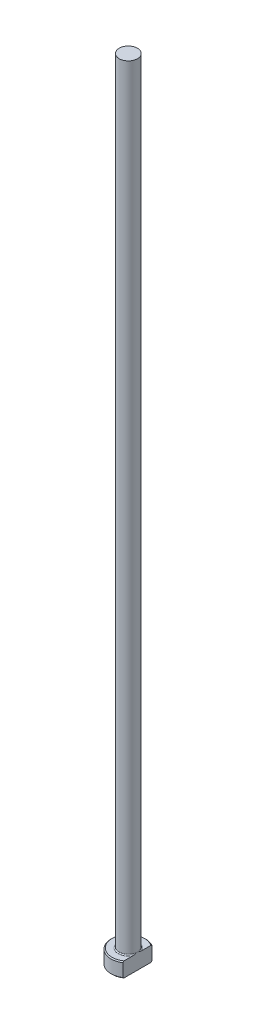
ISO-10303-21;
HEADER;
FILE_DESCRIPTION(('STEP AP214'),'2;1');
FILE_NAME('part.step','',(''),(''),'','','');
FILE_SCHEMA(('AUTOMOTIVE_DESIGN { 1 0 10303 214 1 1 1 1 }'));
ENDSEC;
DATA;
#1=APPLICATION_CONTEXT('core data for automotive mechanical design processes');
#2=APPLICATION_PROTOCOL_DEFINITION('international standard','automotive_design',2000,#1);
#3=PRODUCT_CONTEXT('',#1,'mechanical');
#4=PRODUCT('Part','Part','',(#3));
#5=PRODUCT_RELATED_PRODUCT_CATEGORY('part','',(#4));
#6=PRODUCT_DEFINITION_FORMATION('','',#4);
#7=PRODUCT_DEFINITION_CONTEXT('part definition',#1,'design');
#8=PRODUCT_DEFINITION('design','',#6,#7);
#9=PRODUCT_DEFINITION_SHAPE('','',#8);
#10=(LENGTH_UNIT() NAMED_UNIT(*) SI_UNIT(.MILLI.,.METRE.));
#11=(NAMED_UNIT(*) PLANE_ANGLE_UNIT() SI_UNIT($,.RADIAN.));
#12=(NAMED_UNIT(*) SI_UNIT($,.STERADIAN.) SOLID_ANGLE_UNIT());
#13=UNCERTAINTY_MEASURE_WITH_UNIT(LENGTH_MEASURE(1.E-05),#10,'distance_accuracy_value','');
#14=(GEOMETRIC_REPRESENTATION_CONTEXT(3) GLOBAL_UNCERTAINTY_ASSIGNED_CONTEXT((#13)) GLOBAL_UNIT_ASSIGNED_CONTEXT((#10,
#11,#12)) REPRESENTATION_CONTEXT('',''));
#15=CARTESIAN_POINT('',(0.,0.,0.));
#16=DIRECTION('',(0.,0.,1.));
#17=DIRECTION('',(1.,0.,0.));
#18=AXIS2_PLACEMENT_3D('',#15,#16,#17);
#19=CARTESIAN_POINT('',(0.,0.,0.));
#20=DIRECTION('',(0.,-1.,0.));
#21=DIRECTION('',(0.,0.,-1.));
#22=AXIS2_PLACEMENT_3D('',#19,#20,#21);
#23=PLANE('',#22);
#24=CARTESIAN_POINT('',(0.,0.,0.));
#25=DIRECTION('',(0.,-1.,0.));
#26=DIRECTION('',(0.,0.,-1.));
#27=AXIS2_PLACEMENT_3D('',#24,#25,#26);
#28=CIRCLE('',#27,3.29999999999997);
#29=CARTESIAN_POINT('',(1.84999999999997,0.,2.73267268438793));
#30=VERTEX_POINT('',#29);
#31=CARTESIAN_POINT('',(1.84999999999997,0.,-2.73267268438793));
#32=VERTEX_POINT('',#31);
#33=EDGE_CURVE('E98',#30,#32,#28,.T.);
#34=ORIENTED_EDGE('',*,*,#33,.T.);
#35=DIRECTION('',(0.,0.,1.));
#36=VECTOR('',#35,1.);
#37=CARTESIAN_POINT('',(1.84999999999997,0.,-2.9711109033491));
#38=LINE('',#37,#36);
#39=EDGE_CURVE('E83',#32,#30,#38,.T.);
#40=ORIENTED_EDGE('',*,*,#39,.T.);
#41=EDGE_LOOP('',(#34,#40));
#42=FACE_BOUND('',#41,.T.);
#43=ADVANCED_FACE('F32',(#42),#23,.T.);
#44=CARTESIAN_POINT('',(0.,259.958771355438,0.));
#45=DIRECTION('',(0.,1.,0.));
#46=DIRECTION('',(0.,0.,1.));
#47=AXIS2_PLACEMENT_3D('',#44,#45,#46);
#48=CYLINDRICAL_SURFACE('',#47,3.49999999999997);
#49=CARTESIAN_POINT('',(0.,2.79999999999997,0.));
#50=DIRECTION('',(0.,1.,0.));
#51=DIRECTION('',(0.,0.,1.));
#52=AXIS2_PLACEMENT_3D('',#49,#50,#51);
#53=CIRCLE('',#52,3.49999999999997);
#54=CARTESIAN_POINT('',(1.84999999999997,2.79999999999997,2.9711109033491));
#55=VERTEX_POINT('',#54);
#56=CARTESIAN_POINT('',(1.84999999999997,2.79999999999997,-2.9711109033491));
#57=VERTEX_POINT('',#56);
#58=EDGE_CURVE('E104',#55,#57,#53,.F.);
#59=ORIENTED_EDGE('',*,*,#58,.T.);
#60=DIRECTION('',(0.,-1.,0.));
#61=VECTOR('',#60,1.);
#62=CARTESIAN_POINT('',(1.84999999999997,160.,-2.9711109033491));
#63=LINE('',#62,#61);
#64=CARTESIAN_POINT('',(1.84999999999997,0.199999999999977,-2.9711109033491));
#65=VERTEX_POINT('',#64);
#66=EDGE_CURVE('E183',#57,#65,#63,.T.);
#67=ORIENTED_EDGE('',*,*,#66,.T.);
#68=CARTESIAN_POINT('',(0.,0.199999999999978,0.));
#69=DIRECTION('',(0.,-1.,0.));
#70=DIRECTION('',(0.,0.,-1.));
#71=AXIS2_PLACEMENT_3D('',#68,#69,#70);
#72=CIRCLE('',#71,3.49999999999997);
#73=CARTESIAN_POINT('',(1.84999999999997,0.199999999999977,2.9711109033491));
#74=VERTEX_POINT('',#73);
#75=EDGE_CURVE('E100',#65,#74,#72,.F.);
#76=ORIENTED_EDGE('',*,*,#75,.T.);
#77=DIRECTION('',(0.,-1.,0.));
#78=VECTOR('',#77,1.);
#79=CARTESIAN_POINT('',(1.84999999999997,160.,2.9711109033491));
#80=LINE('',#79,#78);
#81=EDGE_CURVE('E93',#55,#74,#80,.T.);
#82=ORIENTED_EDGE('',*,*,#81,.F.);
#83=EDGE_LOOP('',(#59,#67,#76,#82));
#84=FACE_BOUND('',#83,.T.);
#85=ADVANCED_FACE('F158',(#84),#48,.T.);
#86=CARTESIAN_POINT('',(-3.49999999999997,3.,0.));
#87=DIRECTION('',(0.,1.,0.));
#88=DIRECTION('',(0.,0.,1.));
#89=AXIS2_PLACEMENT_3D('',#86,#87,#88);
#90=PLANE('',#89);
#91=CARTESIAN_POINT('',(0.,3.,0.));
#92=DIRECTION('',(0.,1.,0.));
#93=DIRECTION('',(0.,0.,1.));
#94=AXIS2_PLACEMENT_3D('',#91,#92,#93);
#95=CIRCLE('',#94,3.29999999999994);
#96=CARTESIAN_POINT('',(1.84999999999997,3.,-2.7326726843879));
#97=VERTEX_POINT('',#96);
#98=CARTESIAN_POINT('',(1.84999999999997,3.,2.7326726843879));
#99=VERTEX_POINT('',#98);
#100=EDGE_CURVE('E178',#97,#99,#95,.T.);
#101=ORIENTED_EDGE('',*,*,#100,.T.);
#102=DIRECTION('',(0.,0.,-1.));
#103=VECTOR('',#102,1.);
#104=CARTESIAN_POINT('',(1.84999999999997,3.,0.));
#105=LINE('',#104,#103);
#106=CARTESIAN_POINT('',(1.84999999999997,2.99999999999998,0.883176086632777));
#107=VERTEX_POINT('',#106);
#108=EDGE_CURVE('E57',#99,#107,#105,.T.);
#109=ORIENTED_EDGE('',*,*,#108,.T.);
#110=CARTESIAN_POINT('',(0.,3.,0.));
#111=DIRECTION('',(0.,1.,0.));
#112=DIRECTION('',(0.,0.,1.));
#113=AXIS2_PLACEMENT_3D('',#110,#111,#112);
#114=CIRCLE('',#113,2.04999999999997);
#115=CARTESIAN_POINT('',(1.84999999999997,2.99999999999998,-0.883176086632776));
#116=VERTEX_POINT('',#115);
#117=EDGE_CURVE('E107',#107,#116,#114,.F.);
#118=ORIENTED_EDGE('',*,*,#117,.T.);
#119=EDGE_CURVE('E136',#116,#97,#105,.T.);
#120=ORIENTED_EDGE('',*,*,#119,.T.);
#121=EDGE_LOOP('',(#101,#109,#118,#120));
#122=FACE_BOUND('',#121,.T.);
#123=ADVANCED_FACE('F147',(#122),#90,.T.);
#124=CARTESIAN_POINT('',(0.,3.,0.));
#125=DIRECTION('',(0.,-1.,0.));
#126=DIRECTION('',(0.,0.,-1.));
#127=AXIS2_PLACEMENT_3D('',#124,#125,#126);
#128=CONICAL_SURFACE('',#127,3.29999999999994,0.785398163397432);
#129=ORIENTED_EDGE('',*,*,#58,.F.);
#130=CARTESIAN_POINT('',(1.84999999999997,-0.495337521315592,6.53866286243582));
#131=CARTESIAN_POINT('',(1.84999999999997,-0.367557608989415,6.40586293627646));
#132=CARTESIAN_POINT('',(1.84999999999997,-0.239923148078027,6.27292282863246));
#133=CARTESIAN_POINT('',(1.84999999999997,0.0149855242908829,6.00669544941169));
#134=CARTESIAN_POINT('',(1.84999999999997,0.142259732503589,5.8734081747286));
#135=CARTESIAN_POINT('',(1.84999999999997,0.523515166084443,5.47284424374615));
#136=CARTESIAN_POINT('',(1.84999999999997,0.776848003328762,5.20494969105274));
#137=CARTESIAN_POINT('',(1.84999999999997,1.27905662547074,4.66864873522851));
#138=CARTESIAN_POINT('',(1.84999999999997,1.52795142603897,4.40026022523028));
#139=CARTESIAN_POINT('',(1.84999999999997,1.89802867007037,3.99472739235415));
#140=CARTESIAN_POINT('',(1.84999999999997,2.0208357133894,3.85906701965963));
#141=CARTESIAN_POINT('',(1.84999999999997,2.26498704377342,3.58643788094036));
#142=CARTESIAN_POINT('',(1.84999999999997,2.38633136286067,3.44946914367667));
#143=CARTESIAN_POINT('',(1.84999999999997,2.59253936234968,3.21326235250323));
#144=CARTESIAN_POINT('',(1.84999999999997,2.6778961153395,3.11445520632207));
#145=CARTESIAN_POINT('',(1.84999999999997,2.84729764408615,2.91570924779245));
#146=CARTESIAN_POINT('',(1.84999999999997,2.93134233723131,2.81577036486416));
#147=CARTESIAN_POINT('',(1.84999999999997,3.09808918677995,2.61399668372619));
#148=CARTESIAN_POINT('',(1.84999999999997,3.1807833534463,2.51215526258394));
#149=CARTESIAN_POINT('',(1.84999999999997,3.34381050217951,2.30661634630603));
#150=CARTESIAN_POINT('',(1.84999999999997,3.42414384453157,2.20291913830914));
#151=CARTESIAN_POINT('',(1.84999999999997,3.58217316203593,1.99223162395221));
#152=CARTESIAN_POINT('',(1.84999999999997,3.65984318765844,1.88522173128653));
#153=CARTESIAN_POINT('',(1.84999999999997,3.81046673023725,1.66776579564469));
#154=CARTESIAN_POINT('',(1.84999999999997,3.88341650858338,1.55731712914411));
#155=CARTESIAN_POINT('',(1.84999999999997,4.02186828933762,1.3323802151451));
#156=CARTESIAN_POINT('',(1.84999999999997,4.0873979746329,1.21790922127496));
#157=CARTESIAN_POINT('',(1.84999999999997,4.20734088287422,0.98328899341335));
#158=CARTESIAN_POINT('',(1.84999999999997,4.2617739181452,0.863150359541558));
#159=CARTESIAN_POINT('',(1.84999999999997,4.33092920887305,0.676855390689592));
#160=CARTESIAN_POINT('',(1.84999999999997,4.35204213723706,0.613084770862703));
#161=CARTESIAN_POINT('',(1.84999999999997,4.3887487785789,0.483954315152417));
#162=CARTESIAN_POINT('',(1.84999999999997,4.40434337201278,0.418594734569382));
#163=CARTESIAN_POINT('',(1.84999999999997,4.42895642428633,0.287118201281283));
#164=CARTESIAN_POINT('',(1.84999999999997,4.43802196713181,0.221010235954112));
#165=CARTESIAN_POINT('',(1.84999999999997,4.44908005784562,0.0882006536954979));
#166=CARTESIAN_POINT('',(1.84999999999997,4.4510736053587,0.0214991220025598));
#167=CARTESIAN_POINT('',(1.84999999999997,4.44782172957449,-0.111919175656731));
#168=CARTESIAN_POINT('',(1.84999999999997,4.44255503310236,-0.178635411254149));
#169=CARTESIAN_POINT('',(1.84999999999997,4.42516665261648,-0.311161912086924));
#170=CARTESIAN_POINT('',(1.84999999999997,4.41304353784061,-0.376971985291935));
#171=CARTESIAN_POINT('',(1.84999999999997,4.38266710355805,-0.507684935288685));
#172=CARTESIAN_POINT('',(1.84999999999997,4.36436596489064,-0.572576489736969));
#173=CARTESIAN_POINT('',(1.84999999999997,4.3226826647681,-0.700682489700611));
#174=CARTESIAN_POINT('',(1.84999999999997,4.29930023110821,-0.763896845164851));
#175=CARTESIAN_POINT('',(1.84999999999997,4.24376239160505,-0.900089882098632));
#176=CARTESIAN_POINT('',(1.84999999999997,4.21078445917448,-0.972729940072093));
#177=CARTESIAN_POINT('',(1.84999999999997,4.14042488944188,-1.11586336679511));
#178=CARTESIAN_POINT('',(1.84999999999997,4.10304078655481,-1.18635550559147));
#179=CARTESIAN_POINT('',(1.84999999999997,4.02485037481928,-1.32556755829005));
#180=CARTESIAN_POINT('',(1.84999999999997,3.98403800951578,-1.39428404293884));
#181=CARTESIAN_POINT('',(1.84999999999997,3.89981091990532,-1.53011006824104));
#182=CARTESIAN_POINT('',(1.84999999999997,3.85639567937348,-1.59721928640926));
#183=CARTESIAN_POINT('',(1.84999999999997,3.72220240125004,-1.79793775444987));
#184=CARTESIAN_POINT('',(1.84999999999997,3.62833192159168,-1.92947392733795));
#185=CARTESIAN_POINT('',(1.84999999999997,3.4356113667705,-2.18852608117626));
#186=CARTESIAN_POINT('',(1.84999999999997,3.33676758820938,-2.31604682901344));
#187=CARTESIAN_POINT('',(1.84999999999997,3.16173100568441,-2.53562533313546));
#188=CARTESIAN_POINT('',(1.84999999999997,3.0863122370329,-2.62830296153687));
#189=CARTESIAN_POINT('',(1.84999999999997,2.93402806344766,-2.81246185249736));
#190=CARTESIAN_POINT('',(1.84999999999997,2.8571626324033,-2.90394309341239));
#191=CARTESIAN_POINT('',(1.84999999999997,2.62487459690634,-3.17698997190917));
#192=CARTESIAN_POINT('',(1.84999999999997,2.46778137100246,-3.35713267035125));
#193=CARTESIAN_POINT('',(1.84999999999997,2.15058675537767,-3.71509804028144));
#194=CARTESIAN_POINT('',(1.84999999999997,1.99048215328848,-3.89291784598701));
#195=CARTESIAN_POINT('',(1.84999999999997,1.66834476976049,-4.24677354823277));
#196=CARTESIAN_POINT('',(1.84999999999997,1.50631214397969,-4.42280958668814));
#197=CARTESIAN_POINT('',(1.84999999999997,1.19192013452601,-4.76168963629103));
#198=CARTESIAN_POINT('',(1.84999999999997,1.03965111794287,-4.92461766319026));
#199=CARTESIAN_POINT('',(1.84999999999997,0.734208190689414,-5.24963033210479));
#200=CARTESIAN_POINT('',(1.84999999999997,0.581034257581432,-5.41171495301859));
#201=CARTESIAN_POINT('',(1.84999999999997,0.274298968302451,-5.73490774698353));
#202=CARTESIAN_POINT('',(1.84999999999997,0.120738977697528,-5.89601721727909));
#203=CARTESIAN_POINT('',(1.84999999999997,-0.186924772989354,-6.21770486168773));
#204=CARTESIAN_POINT('',(1.84999999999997,-0.341028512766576,-6.37828305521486));
#205=CARTESIAN_POINT('',(1.84999999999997,-0.495337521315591,-6.53866286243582));
#206=B_SPLINE_CURVE_WITH_KNOTS('',3,(#130,#131,#132,#133,#134,#135,#136,#137,#138,#139,#140,
#141,#142,#143,#144,#145,#146,#147,#148,#149,#150,#151,#152,#153,#154,#155,#156,#157,#158,#159,
#160,#161,#162,#163,#164,#165,#166,#167,#168,#169,#170,#171,#172,#173,#174,#175,#176,#177,#178,
#179,#180,#181,#182,#183,#184,#185,#186,#187,#188,#189,#190,#191,#192,#193,#194,#195,#196,#197,
#198,#199,#200,#201,#202,#203,#204,#205),.UNSPECIFIED.,.F.,.F.,(4,2,2,2,2,2,2,2,2,2,2,2,2,2,2,2,
2,2,2,2,2,2,2,2,2,2,2,2,2,2,2,2,2,2,2,2,2,4),(0.,0.552875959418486,1.10575688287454,
2.21186966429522,3.30993774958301,3.85890041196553,4.40785103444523,4.79955362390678,
5.1912807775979,5.58481647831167,5.97829180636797,6.37488572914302,6.77179001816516,
7.16716102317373,7.56181981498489,7.76314684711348,7.96444174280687,8.16427006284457,
8.36407013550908,8.56445688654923,8.76488546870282,8.96690240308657,9.16893016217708,
9.40805718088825,9.64731865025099,9.88701207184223,10.1267531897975,10.6113114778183,
11.0952709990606,11.4537140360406,11.812163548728,12.5291632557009,13.2469768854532,
13.9647329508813,14.6337450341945,15.3027737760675,15.9704792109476,16.6381599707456),.UNSPECIFIED.);
#207=EDGE_CURVE('E135',#55,#99,#206,.T.);
#208=ORIENTED_EDGE('',*,*,#207,.T.);
#209=ORIENTED_EDGE('',*,*,#100,.F.);
#210=EDGE_CURVE('E127',#97,#57,#206,.T.);
#211=ORIENTED_EDGE('',*,*,#210,.T.);
#212=EDGE_LOOP('',(#129,#208,#209,#211));
#213=FACE_BOUND('',#212,.T.);
#214=ADVANCED_FACE('F143',(#213),#128,.T.);
#215=CARTESIAN_POINT('',(0.,0.199999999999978,0.));
#216=DIRECTION('',(0.,1.,0.));
#217=DIRECTION('',(0.,0.,1.));
#218=AXIS2_PLACEMENT_3D('',#215,#216,#217);
#219=CONICAL_SURFACE('',#218,3.49999999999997,0.785398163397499);
#220=ORIENTED_EDGE('',*,*,#75,.F.);
#221=CARTESIAN_POINT('',(1.84999999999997,3.4953375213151,-6.53866286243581));
#222=CARTESIAN_POINT('',(1.84999999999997,3.36755760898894,-6.40586293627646));
#223=CARTESIAN_POINT('',(1.84999999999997,3.23992314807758,-6.27292282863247));
#224=CARTESIAN_POINT('',(1.84999999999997,2.98501447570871,-6.00669544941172));
#225=CARTESIAN_POINT('',(1.84999999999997,2.85774026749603,-5.87340817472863));
#226=CARTESIAN_POINT('',(1.84999999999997,2.47648483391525,-5.4728442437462));
#227=CARTESIAN_POINT('',(1.84999999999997,2.22315199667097,-5.2049496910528));
#228=CARTESIAN_POINT('',(1.84999999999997,1.72094337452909,-4.6686487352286));
#229=CARTESIAN_POINT('',(1.84999999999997,1.47204857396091,-4.40026022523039));
#230=CARTESIAN_POINT('',(1.84999999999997,1.10197132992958,-3.99472739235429));
#231=CARTESIAN_POINT('',(1.84999999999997,0.979164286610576,-3.85906701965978));
#232=CARTESIAN_POINT('',(1.84999999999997,0.735012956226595,-3.58643788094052));
#233=CARTESIAN_POINT('',(1.84999999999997,0.613668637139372,-3.44946914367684));
#234=CARTESIAN_POINT('',(1.84999999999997,0.407460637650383,-3.2132623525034));
#235=CARTESIAN_POINT('',(1.84999999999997,0.322103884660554,-3.11445520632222));
#236=CARTESIAN_POINT('',(1.84999999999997,0.152702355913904,-2.91570924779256));
#237=CARTESIAN_POINT('',(1.84999999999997,0.0686576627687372,-2.81577036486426));
#238=CARTESIAN_POINT('',(1.84999999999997,-0.0980891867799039,-2.61399668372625));
#239=CARTESIAN_POINT('',(1.84999999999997,-0.180783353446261,-2.51215526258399));
#240=CARTESIAN_POINT('',(1.84999999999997,-0.343810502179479,-2.30661634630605));
#241=CARTESIAN_POINT('',(1.84999999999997,-0.424143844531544,-2.20291913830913));
#242=CARTESIAN_POINT('',(1.84999999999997,-0.582173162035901,-1.99223162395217));
#243=CARTESIAN_POINT('',(1.84999999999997,-0.659843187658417,-1.88522173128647));
#244=CARTESIAN_POINT('',(1.84999999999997,-0.810466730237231,-1.6677657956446));
#245=CARTESIAN_POINT('',(1.84999999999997,-0.883416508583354,-1.557317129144));
#246=CARTESIAN_POINT('',(1.84999999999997,-1.0218682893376,-1.33238021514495));
#247=CARTESIAN_POINT('',(1.84999999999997,-1.08739797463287,-1.21790922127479));
#248=CARTESIAN_POINT('',(1.84999999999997,-1.20734088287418,-0.983288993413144));
#249=CARTESIAN_POINT('',(1.84999999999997,-1.26177391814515,-0.863150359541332));
#250=CARTESIAN_POINT('',(1.84999999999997,-1.33092920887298,-0.676855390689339));
#251=CARTESIAN_POINT('',(1.84999999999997,-1.35204213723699,-0.613084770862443));
#252=CARTESIAN_POINT('',(1.84999999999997,-1.38874877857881,-0.483954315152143));
#253=CARTESIAN_POINT('',(1.84999999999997,-1.40434337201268,-0.4185947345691));
#254=CARTESIAN_POINT('',(1.84999999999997,-1.42895642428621,-0.287118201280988));
#255=CARTESIAN_POINT('',(1.84999999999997,-1.43802196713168,-0.221010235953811));
#256=CARTESIAN_POINT('',(1.84999999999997,-1.44908005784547,-0.0882006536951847));
#257=CARTESIAN_POINT('',(1.84999999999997,-1.45107360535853,-0.0214991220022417));
#258=CARTESIAN_POINT('',(1.84999999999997,-1.4478217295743,0.111919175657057));
#259=CARTESIAN_POINT('',(1.84999999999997,-1.44255503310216,0.178635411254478));
#260=CARTESIAN_POINT('',(1.84999999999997,-1.42516665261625,0.311161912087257));
#261=CARTESIAN_POINT('',(1.84999999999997,-1.41304353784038,0.37697198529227));
#262=CARTESIAN_POINT('',(1.84999999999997,-1.3826671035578,0.507684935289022));
#263=CARTESIAN_POINT('',(1.84999999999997,-1.36436596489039,0.572576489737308));
#264=CARTESIAN_POINT('',(1.84999999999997,-1.32268266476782,0.700682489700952));
#265=CARTESIAN_POINT('',(1.84999999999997,-1.29930023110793,0.763896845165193));
#266=CARTESIAN_POINT('',(1.84999999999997,-1.24376239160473,0.900089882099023));
#267=CARTESIAN_POINT('',(1.84999999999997,-1.21078445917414,0.97272994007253));
#268=CARTESIAN_POINT('',(1.84999999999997,-1.14042488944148,1.11586336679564));
#269=CARTESIAN_POINT('',(1.84999999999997,-1.10304078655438,1.18635550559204));
#270=CARTESIAN_POINT('',(1.84999999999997,-1.02485037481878,1.32556755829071));
#271=CARTESIAN_POINT('',(1.84999999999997,-0.984038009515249,1.39428404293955));
#272=CARTESIAN_POINT('',(1.84999999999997,-0.899810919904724,1.53011006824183));
#273=CARTESIAN_POINT('',(1.84999999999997,-0.856395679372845,1.5972192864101));
#274=CARTESIAN_POINT('',(1.84999999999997,-0.722202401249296,1.79793775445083));
#275=CARTESIAN_POINT('',(1.84999999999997,-0.628331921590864,1.92947392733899));
#276=CARTESIAN_POINT('',(1.84999999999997,-0.43561136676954,2.18852608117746));
#277=CARTESIAN_POINT('',(1.84999999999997,-0.33676758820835,2.31604682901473));
#278=CARTESIAN_POINT('',(1.84999999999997,-0.161731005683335,2.53562533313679));
#279=CARTESIAN_POINT('',(1.84999999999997,-0.0863122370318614,2.62830296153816));
#280=CARTESIAN_POINT('',(1.84999999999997,0.0659719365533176,2.81246185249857));
#281=CARTESIAN_POINT('',(1.84999999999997,0.142837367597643,2.90394309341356));
#282=CARTESIAN_POINT('',(1.84999999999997,0.375125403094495,3.17698997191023));
#283=CARTESIAN_POINT('',(1.84999999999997,0.532218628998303,3.35713267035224));
#284=CARTESIAN_POINT('',(1.84999999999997,0.849413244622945,3.71509804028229));
#285=CARTESIAN_POINT('',(1.84999999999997,1.00951784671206,3.89291784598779));
#286=CARTESIAN_POINT('',(1.84999999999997,1.33165523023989,4.24677354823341));
#287=CARTESIAN_POINT('',(1.84999999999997,1.49368785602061,4.42280958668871));
#288=CARTESIAN_POINT('',(1.84999999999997,1.80807986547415,4.7616896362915));
#289=CARTESIAN_POINT('',(1.84999999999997,1.96034888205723,4.92461766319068));
#290=CARTESIAN_POINT('',(1.84999999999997,2.26579180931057,5.24963033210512));
#291=CARTESIAN_POINT('',(1.84999999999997,2.41896574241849,5.41171495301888));
#292=CARTESIAN_POINT('',(1.84999999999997,2.72570103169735,5.73490774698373));
#293=CARTESIAN_POINT('',(1.84999999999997,2.87926102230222,5.89601721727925));
#294=CARTESIAN_POINT('',(1.84999999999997,3.18692477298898,6.21770486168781));
#295=CARTESIAN_POINT('',(1.84999999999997,3.34102851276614,6.37828305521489));
#296=CARTESIAN_POINT('',(1.84999999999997,3.49533752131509,6.53866286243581));
#297=B_SPLINE_CURVE_WITH_KNOTS('',3,(#221,#222,#223,#224,#225,#226,#227,#228,#229,#230,#231,
#232,#233,#234,#235,#236,#237,#238,#239,#240,#241,#242,#243,#244,#245,#246,#247,#248,#249,#250,
#251,#252,#253,#254,#255,#256,#257,#258,#259,#260,#261,#262,#263,#264,#265,#266,#267,#268,#269,
#270,#271,#272,#273,#274,#275,#276,#277,#278,#279,#280,#281,#282,#283,#284,#285,#286,#287,#288,
#289,#290,#291,#292,#293,#294,#295,#296),.UNSPECIFIED.,.F.,.F.,(4,2,2,2,2,2,2,2,2,2,2,2,2,2,2,2,
2,2,2,2,2,2,2,2,2,2,2,2,2,2,2,2,2,2,2,2,2,4),(0.,0.552875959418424,1.10575688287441,
2.21186966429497,3.30993774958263,3.85890041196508,4.40785103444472,4.79955362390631,
5.19128077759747,5.58481647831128,5.97829180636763,6.37488572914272,6.77179001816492,
7.16716102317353,7.56181981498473,7.76314684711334,7.96444174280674,8.16427006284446,
8.36407013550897,8.56445688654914,8.76488546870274,8.9669024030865,9.16893016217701,
9.40805718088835,9.64731865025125,9.88701207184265,10.1267531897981,10.6113114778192,
11.0952709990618,11.4537140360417,11.812163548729,12.5291632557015,13.2469768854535,
13.9647329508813,14.6337450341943,15.3027737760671,15.970479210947,16.6381599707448),.UNSPECIFIED.);
#298=EDGE_CURVE('E86',#65,#32,#297,.T.);
#299=ORIENTED_EDGE('',*,*,#298,.T.);
#300=ORIENTED_EDGE('',*,*,#33,.F.);
#301=EDGE_CURVE('E89',#30,#74,#297,.T.);
#302=ORIENTED_EDGE('',*,*,#301,.T.);
#303=EDGE_LOOP('',(#220,#299,#300,#302));
#304=FACE_BOUND('',#303,.T.);
#305=ADVANCED_FACE('F97',(#304),#219,.T.);
#306=CARTESIAN_POINT('',(0.,3.19999999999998,0.));
#307=DIRECTION('',(0.,1.,0.));
#308=DIRECTION('',(0.,0.,1.));
#309=AXIS2_PLACEMENT_3D('',#306,#307,#308);
#310=TOROIDAL_SURFACE('',#309,2.04999999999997,0.2);
#311=CARTESIAN_POINT('',(1.84999999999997,3.19999999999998,0.));
#312=CARTESIAN_POINT('',(1.84999999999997,3.2000005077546,9.34667894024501E-11));
#313=CARTESIAN_POINT('',(1.84999999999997,3.20000101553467,-1.39523774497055E-07));
#314=CARTESIAN_POINT('',(1.84999999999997,3.20000198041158,-5.58117212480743E-07));
#315=CARTESIAN_POINT('',(1.84999999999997,3.20000243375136,-8.43654614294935E-07));
#316=CARTESIAN_POINT('',(1.84999999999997,3.20000334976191,-1.52578120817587E-06));
#317=CARTESIAN_POINT('',(1.84999999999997,3.20000380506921,-1.93226270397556E-06));
#318=CARTESIAN_POINT('',(1.84999999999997,3.20000464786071,-2.79453374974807E-06));
#319=CARTESIAN_POINT('',(1.84999999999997,3.2000050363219,-3.24942047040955E-06));
#320=CARTESIAN_POINT('',(1.84999999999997,3.20000639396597,-4.93179089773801E-06));
#321=CARTESIAN_POINT('',(1.84999999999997,3.20000728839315,-6.22116400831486E-06));
#322=CARTESIAN_POINT('',(1.84999999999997,3.20000883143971,-8.83821977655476E-06));
#323=CARTESIAN_POINT('',(1.84999999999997,3.20000949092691,-1.0159828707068E-05));
#324=CARTESIAN_POINT('',(1.84999999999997,3.20001208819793,-1.55027353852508E-05));
#325=CARTESIAN_POINT('',(1.84999999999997,3.20001391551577,-1.95815621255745E-05));
#326=CARTESIAN_POINT('',(1.84999999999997,3.20001678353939,-2.74812027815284E-05));
#327=CARTESIAN_POINT('',(1.84999999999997,3.20001789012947,-3.12784972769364E-05));
#328=CARTESIAN_POINT('',(1.84999999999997,3.20002278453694,-4.79402305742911E-05));
#329=CARTESIAN_POINT('',(1.84999999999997,3.20002665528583,-6.07698221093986E-05));
#330=CARTESIAN_POINT('',(1.84999999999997,3.20003266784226,-8.44896575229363E-05));
#331=CARTESIAN_POINT('',(1.84999999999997,3.20003499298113,-9.53309677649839E-05));
#332=CARTESIAN_POINT('',(1.84999999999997,3.20005390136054,-0.000176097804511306));
#333=CARTESIAN_POINT('',(1.84999999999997,3.20007870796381,-0.000243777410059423));
#334=CARTESIAN_POINT('',(1.84999999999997,3.20017277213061,-0.000509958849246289));
#335=CARTESIAN_POINT('',(1.84999999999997,3.20023587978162,-0.000710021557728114));
#336=CARTESIAN_POINT('',(1.84999999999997,3.20048776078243,-0.00149717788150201));
#337=CARTESIAN_POINT('',(1.84999999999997,3.20068297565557,-0.00208268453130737));
#338=CARTESIAN_POINT('',(1.84999999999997,3.20148579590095,-0.00450164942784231));
#339=CARTESIAN_POINT('',(1.84999999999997,3.20208611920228,-0.00633684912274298));
#340=CARTESIAN_POINT('',(1.84999999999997,3.20840458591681,-0.0256382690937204));
#341=CARTESIAN_POINT('',(1.84999999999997,3.21415962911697,-0.0430958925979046));
#342=CARTESIAN_POINT('',(1.84999999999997,3.22539112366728,-0.0773573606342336));
#343=CARTESIAN_POINT('',(1.84999999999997,3.23086978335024,-0.094160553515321));
#344=CARTESIAN_POINT('',(1.84999999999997,3.24243350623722,-0.129835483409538));
#345=CARTESIAN_POINT('',(1.84999999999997,3.24851108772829,-0.148709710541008));
#346=CARTESIAN_POINT('',(1.84999999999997,3.26060732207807,-0.186696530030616));
#347=CARTESIAN_POINT('',(1.84999999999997,3.26662467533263,-0.205809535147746));
#348=CARTESIAN_POINT('',(1.84999999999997,3.28116945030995,-0.252722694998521));
#349=CARTESIAN_POINT('',(1.84999999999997,3.28960449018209,-0.280551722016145));
#350=CARTESIAN_POINT('',(1.84999999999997,3.30577848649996,-0.335676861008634));
#351=CARTESIAN_POINT('',(1.84999999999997,3.31352939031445,-0.362969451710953));
#352=CARTESIAN_POINT('',(1.84999999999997,3.32966638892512,-0.422337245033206));
#353=CARTESIAN_POINT('',(1.84999999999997,3.33793948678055,-0.454443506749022));
#354=CARTESIAN_POINT('',(1.84999999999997,3.35343207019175,-0.519160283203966));
#355=CARTESIAN_POINT('',(1.84999999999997,3.36064342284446,-0.551772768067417));
#356=CARTESIAN_POINT('',(1.84999999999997,3.37406239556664,-0.619533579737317));
#357=CARTESIAN_POINT('',(1.84999999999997,3.38016747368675,-0.654702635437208));
#358=CARTESIAN_POINT('',(1.84999999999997,3.39023253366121,-0.72534332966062));
#359=CARTESIAN_POINT('',(1.84999999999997,3.39419343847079,-0.76081483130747));
#360=CARTESIAN_POINT('',(1.84999999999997,3.3992299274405,-0.830684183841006));
#361=CARTESIAN_POINT('',(1.84999999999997,3.40040481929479,-0.865074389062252));
#362=CARTESIAN_POINT('',(1.84999999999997,3.39935188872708,-0.933419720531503));
#363=CARTESIAN_POINT('',(1.84999999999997,3.39716621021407,-0.967374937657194));
#364=CARTESIAN_POINT('',(1.84999999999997,3.3892911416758,-1.02700506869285));
#365=CARTESIAN_POINT('',(1.84999999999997,3.3845176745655,-1.0527972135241));
#366=CARTESIAN_POINT('',(1.84999999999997,3.37142827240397,-1.10352321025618));
#367=CARTESIAN_POINT('',(1.84999999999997,3.36311751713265,-1.12845825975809));
#368=CARTESIAN_POINT('',(1.84999999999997,3.34739902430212,-1.16341995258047));
#369=CARTESIAN_POINT('',(1.84999999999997,3.34188173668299,-1.17429318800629));
#370=CARTESIAN_POINT('',(1.84999999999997,3.32959648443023,-1.19534735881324));
#371=CARTESIAN_POINT('',(1.84999999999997,3.32282672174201,-1.20552726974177));
#372=CARTESIAN_POINT('',(1.84999999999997,3.30772953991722,-1.22494096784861));
#373=CARTESIAN_POINT('',(1.84999999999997,3.29937943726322,-1.23415748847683));
#374=CARTESIAN_POINT('',(1.84999999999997,3.28103367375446,-1.25077218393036));
#375=CARTESIAN_POINT('',(1.84999999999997,3.2710465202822,-1.25817929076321));
#376=CARTESIAN_POINT('',(1.84999999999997,3.25422744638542,-1.26760493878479));
#377=CARTESIAN_POINT('',(1.84999999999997,3.24792179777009,-1.27056416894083));
#378=CARTESIAN_POINT('',(1.84999999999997,3.2349110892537,-1.27542089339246));
#379=CARTESIAN_POINT('',(1.84999999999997,3.22820636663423,-1.27731927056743));
#380=CARTESIAN_POINT('',(1.84999999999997,3.21452301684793,-1.27990697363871));
#381=CARTESIAN_POINT('',(1.84999999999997,3.20754302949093,-1.28058924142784));
#382=CARTESIAN_POINT('',(1.84999999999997,3.193576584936,-1.28065770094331));
#383=CARTESIAN_POINT('',(1.84999999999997,3.18659012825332,-1.28004398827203));
#384=CARTESIAN_POINT('',(1.84999999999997,3.17336954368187,-1.27767477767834));
#385=CARTESIAN_POINT('',(1.84999999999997,3.16711869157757,-1.27600999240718));
#386=CARTESIAN_POINT('',(1.84999999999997,3.15494695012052,-1.2717474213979));
#387=CARTESIAN_POINT('',(1.84999999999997,3.14902619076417,-1.26914927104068));
#388=CARTESIAN_POINT('',(1.84999999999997,3.13522495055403,-1.26192664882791));
#389=CARTESIAN_POINT('',(1.84999999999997,3.12755069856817,-1.25690871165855));
#390=CARTESIAN_POINT('',(1.84999999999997,3.11310151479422,-1.24571119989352));
#391=CARTESIAN_POINT('',(1.84999999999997,3.10632887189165,-1.23952876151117));
#392=CARTESIAN_POINT('',(1.84999999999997,3.0902441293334,-1.22278329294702));
#393=CARTESIAN_POINT('',(1.84999999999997,3.08152632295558,-1.21165307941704));
#394=CARTESIAN_POINT('',(1.84999999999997,3.06587834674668,-1.18823434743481));
#395=CARTESIAN_POINT('',(1.84999999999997,3.05894991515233,-1.17594471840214));
#396=CARTESIAN_POINT('',(1.84999999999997,3.04177106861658,-1.14085188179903));
#397=CARTESIAN_POINT('',(1.84999999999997,3.03310568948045,-1.11728001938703));
#398=CARTESIAN_POINT('',(1.84999999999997,3.01913803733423,-1.06899459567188));
#399=CARTESIAN_POINT('',(1.84999999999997,3.01387019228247,-1.04427198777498));
#400=CARTESIAN_POINT('',(1.84999999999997,3.00587460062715,-0.993668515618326));
#401=CARTESIAN_POINT('',(1.84999999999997,3.00322848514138,-0.967775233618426));
#402=CARTESIAN_POINT('',(1.84999999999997,3.00014743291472,-0.915820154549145));
#403=CARTESIAN_POINT('',(1.84999999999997,2.99971730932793,-0.889758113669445));
#404=CARTESIAN_POINT('',(1.84999999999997,3.00104547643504,-0.813795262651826));
#405=CARTESIAN_POINT('',(1.84999999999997,3.00517104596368,-0.763940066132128));
#406=CARTESIAN_POINT('',(1.84999999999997,3.01814671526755,-0.66244627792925));
#407=CARTESIAN_POINT('',(1.84999999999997,3.02721778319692,-0.610839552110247));
#408=CARTESIAN_POINT('',(1.84999999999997,3.04894158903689,-0.507119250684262));
#409=CARTESIAN_POINT('',(1.84999999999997,3.0616746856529,-0.455023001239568));
#410=CARTESIAN_POINT('',(1.84999999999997,3.08496950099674,-0.368082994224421));
#411=CARTESIAN_POINT('',(1.84999999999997,3.09491636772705,-0.333068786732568));
#412=CARTESIAN_POINT('',(1.84999999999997,3.11545203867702,-0.263636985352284));
#413=CARTESIAN_POINT('',(1.84999999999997,3.12603282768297,-0.229217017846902));
#414=CARTESIAN_POINT('',(1.84999999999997,3.14646003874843,-0.164292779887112));
#415=CARTESIAN_POINT('',(1.84999999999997,3.15625955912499,-0.133773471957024));
#416=CARTESIAN_POINT('',(1.84999999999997,3.17649314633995,-0.0715631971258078));
#417=CARTESIAN_POINT('',(1.84999999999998,3.18693679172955,-0.0398752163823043));
#418=CARTESIAN_POINT('',(1.84999999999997,3.19791459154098,-0.00633433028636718));
#419=CARTESIAN_POINT('',(1.84999999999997,3.19851581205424,-0.00449665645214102));
#420=CARTESIAN_POINT('',(1.84999999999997,3.19931885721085,-0.00207711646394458));
#421=CARTESIAN_POINT('',(1.84999999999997,3.19951343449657,-0.00149351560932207));
#422=CARTESIAN_POINT('',(1.84999999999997,3.19976454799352,-0.000708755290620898));
#423=CARTESIAN_POINT('',(1.84999999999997,3.19982750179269,-0.000509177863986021));
#424=CARTESIAN_POINT('',(1.84999999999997,3.19992136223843,-0.000243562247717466));
#425=CARTESIAN_POINT('',(1.84999999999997,3.19994613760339,-0.00017596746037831));
#426=CARTESIAN_POINT('',(1.84999999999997,3.19996502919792,-9.52949953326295E-05));
#427=CARTESIAN_POINT('',(1.84999999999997,3.19996735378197,-8.44593557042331E-05));
#428=CARTESIAN_POINT('',(1.84999999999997,3.19997336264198,-6.07523436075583E-05));
#429=CARTESIAN_POINT('',(1.84999999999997,3.19997722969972,-4.79297585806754E-05));
#430=CARTESIAN_POINT('',(1.84999999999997,3.1999821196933,-3.12758458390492E-05));
#431=CARTESIAN_POINT('',(1.84999999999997,3.19998322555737,-2.74793613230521E-05));
#432=CARTESIAN_POINT('',(1.84999999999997,3.19998609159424,-1.95813053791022E-05));
#433=CARTESIAN_POINT('',(1.84999999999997,3.19998791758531,-1.55032186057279E-05));
#434=CARTESIAN_POINT('',(1.84999999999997,3.19999051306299,-1.01610398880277E-05));
#435=CARTESIAN_POINT('',(1.84999999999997,3.19999117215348,-8.83949266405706E-06));
#436=CARTESIAN_POINT('',(1.84999999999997,3.19999271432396,-6.22248600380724E-06));
#437=CARTESIAN_POINT('',(1.84999999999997,3.19999360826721,-4.93309439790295E-06));
#438=CARTESIAN_POINT('',(1.84999999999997,3.19999496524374,-3.25061146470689E-06));
#439=CARTESIAN_POINT('',(1.84999999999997,3.19999535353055,-2.79567390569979E-06));
#440=CARTESIAN_POINT('',(1.84999999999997,3.19999619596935,-1.93326976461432E-06));
#441=CARTESIAN_POINT('',(1.84999999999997,3.19999665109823,-1.52670538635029E-06));
#442=CARTESIAN_POINT('',(1.84999999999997,3.19999756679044,-8.44380236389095E-07));
#443=CARTESIAN_POINT('',(1.84999999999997,3.19999801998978,-5.58732781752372E-07));
#444=CARTESIAN_POINT('',(1.84999999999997,3.19999898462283,-1.39868280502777E-07));
#445=CARTESIAN_POINT('',(1.84999999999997,3.19999949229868,-9.34569741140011E-11));
#446=CARTESIAN_POINT('',(1.84999999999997,3.19999999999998,0.));
#447=B_SPLINE_CURVE_WITH_KNOTS('',3,(#311,#312,#313,#314,#315,#316,#317,#318,#319,#320,#321,
#322,#323,#324,#325,#326,#327,#328,#329,#330,#331,#332,#333,#334,#335,#336,#337,#338,#339,#340,
#341,#342,#343,#344,#345,#346,#347,#348,#349,#350,#351,#352,#353,#354,#355,#356,#357,#358,#359,
#360,#361,#362,#363,#364,#365,#366,#367,#368,#369,#370,#371,#372,#373,#374,#375,#376,#377,#378,
#379,#380,#381,#382,#383,#384,#385,#386,#387,#388,#389,#390,#391,#392,#393,#394,#395,#396,#397,
#398,#399,#400,#401,#402,#403,#404,#405,#406,#407,#408,#409,#410,#411,#412,#413,#414,#415,#416,
#417,#418,#419,#420,#421,#422,#423,#424,#425,#426,#427,#428,#429,#430,#431,#432,#433,#434,#435,
#436,#437,#438,#439,#440,#441,#442,#443,#444,#445,#446),.UNSPECIFIED.,.T.,.F.,(4,2,2,2,2,2,2,2,
2,2,2,2,2,2,2,2,2,2,2,2,2,2,2,2,2,2,2,2,2,2,2,2,2,2,2,2,2,2,2,2,2,2,2,2,2,2,2,2,2,2,2,2,2,2,2,2,
2,2,2,2,2,2,2,2,2,2,2,4),(0.,1.5255475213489E-06,3.12667082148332E-06,4.94899432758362E-06,
6.74187316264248E-06,1.14287265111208E-05,1.58560812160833E-05,2.9231971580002E-05,
4.10845153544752E-05,8.12839315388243E-05,0.000114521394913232,0.000330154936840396,
0.000960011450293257,0.0028109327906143,0.0086043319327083,0.0637452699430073,0.116767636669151,
0.176252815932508,0.236366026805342,0.323600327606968,0.408710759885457,0.508160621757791,
0.608336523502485,0.715371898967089,0.822361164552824,0.925475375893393,1.02730696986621,
1.10584278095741,1.18426398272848,1.22078073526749,1.25735032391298,1.29449125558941,
1.33144496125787,1.35226401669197,1.37306571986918,1.39398776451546,1.41490826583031,
1.43423216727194,1.45356362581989,1.48091639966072,1.50833734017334,1.55051201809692,
1.59272751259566,1.66764967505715,1.74331958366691,1.82127778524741,1.8994052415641,
2.04914452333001,2.2061992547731,2.36700451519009,2.47619575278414,2.5842176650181,
2.680380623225,2.78046602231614,2.7862672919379,2.78811218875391,2.78874051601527,
2.78895587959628,2.78898910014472,2.78902927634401,2.78904112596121,2.78905449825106,
2.78905892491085,2.78906361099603,2.78906540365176,2.78906722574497,2.78906882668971,
2.78907035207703),.UNSPECIFIED.);
#448=CARTESIAN_POINT('',(1.84999999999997,3.19999999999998,0.));
#449=VERTEX_POINT('',#448);
#450=EDGE_CURVE('E11',#116,#449,#447,.T.);
#451=ORIENTED_EDGE('',*,*,#450,.F.);
#452=ORIENTED_EDGE('',*,*,#117,.F.);
#453=CARTESIAN_POINT('',(1.84999999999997,3.19999999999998,0.));
#454=CARTESIAN_POINT('',(1.84999999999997,3.19999949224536,-9.34668148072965E-11));
#455=CARTESIAN_POINT('',(1.84999999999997,3.19999898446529,1.39523774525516E-07));
#456=CARTESIAN_POINT('',(1.84999999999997,3.19999801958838,5.58117212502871E-07));
#457=CARTESIAN_POINT('',(1.84999999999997,3.19999756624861,8.4365461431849E-07));
#458=CARTESIAN_POINT('',(1.84999999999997,3.19999665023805,1.5257812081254E-06));
#459=CARTESIAN_POINT('',(1.84999999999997,3.19999619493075,1.93226270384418E-06));
#460=CARTESIAN_POINT('',(1.84999999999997,3.19999535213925,2.7945337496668E-06));
#461=CARTESIAN_POINT('',(1.84999999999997,3.19999496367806,3.24942047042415E-06));
#462=CARTESIAN_POINT('',(1.84999999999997,3.19999360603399,4.93179089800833E-06));
#463=CARTESIAN_POINT('',(1.84999999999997,3.19999271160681,6.22116400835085E-06));
#464=CARTESIAN_POINT('',(1.84999999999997,3.19999116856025,8.83821977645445E-06));
#465=CARTESIAN_POINT('',(1.84999999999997,3.19999050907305,1.01598287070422E-05));
#466=CARTESIAN_POINT('',(1.84999999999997,3.19998791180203,1.55027353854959E-05));
#467=CARTESIAN_POINT('',(1.84999999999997,3.19998608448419,1.95815621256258E-05));
#468=CARTESIAN_POINT('',(1.84999999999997,3.19998321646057,2.74812027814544E-05));
#469=CARTESIAN_POINT('',(1.84999999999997,3.19998210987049,3.12784972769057E-05));
#470=CARTESIAN_POINT('',(1.84999999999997,3.19997721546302,4.79402305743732E-05));
#471=CARTESIAN_POINT('',(1.84999999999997,3.19997334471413,6.07698221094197E-05));
#472=CARTESIAN_POINT('',(1.84999999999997,3.1999673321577,8.44896575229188E-05));
#473=CARTESIAN_POINT('',(1.84999999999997,3.19996500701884,9.53309677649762E-05));
#474=CARTESIAN_POINT('',(1.84999999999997,3.19994609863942,0.000176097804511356));
#475=CARTESIAN_POINT('',(1.84999999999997,3.19992129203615,0.000243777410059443));
#476=CARTESIAN_POINT('',(1.84999999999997,3.19982722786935,0.000509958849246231));
#477=CARTESIAN_POINT('',(1.84999999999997,3.19976412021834,0.000710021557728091));
#478=CARTESIAN_POINT('',(1.84999999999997,3.19951223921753,0.00149717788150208));
#479=CARTESIAN_POINT('',(1.84999999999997,3.19931702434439,0.0020826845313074));
#480=CARTESIAN_POINT('',(1.84999999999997,3.19851420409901,0.00450164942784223));
#481=CARTESIAN_POINT('',(1.84999999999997,3.19791388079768,0.00633684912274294));
#482=CARTESIAN_POINT('',(1.84999999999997,3.19159541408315,0.0256382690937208));
#483=CARTESIAN_POINT('',(1.84999999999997,3.18584037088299,0.0430958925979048));
#484=CARTESIAN_POINT('',(1.84999999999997,3.17460887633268,0.0773573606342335));
#485=CARTESIAN_POINT('',(1.84999999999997,3.16913021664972,0.0941605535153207));
#486=CARTESIAN_POINT('',(1.84999999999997,3.15756649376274,0.129835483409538));
#487=CARTESIAN_POINT('',(1.84999999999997,3.15148891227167,0.148709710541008));
#488=CARTESIAN_POINT('',(1.84999999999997,3.13939267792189,0.186696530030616));
#489=CARTESIAN_POINT('',(1.84999999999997,3.13337532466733,0.205809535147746));
#490=CARTESIAN_POINT('',(1.84999999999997,3.11883054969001,0.252722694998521));
#491=CARTESIAN_POINT('',(1.84999999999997,3.11039550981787,0.280551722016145));
#492=CARTESIAN_POINT('',(1.84999999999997,3.0942215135,0.335676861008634));
#493=CARTESIAN_POINT('',(1.84999999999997,3.08647060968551,0.362969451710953));
#494=CARTESIAN_POINT('',(1.84999999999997,3.07033361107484,0.422337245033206));
#495=CARTESIAN_POINT('',(1.84999999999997,3.06206051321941,0.454443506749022));
#496=CARTESIAN_POINT('',(1.84999999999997,3.04656792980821,0.519160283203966));
#497=CARTESIAN_POINT('',(1.84999999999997,3.0393565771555,0.551772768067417));
#498=CARTESIAN_POINT('',(1.84999999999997,3.02593760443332,0.619533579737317));
#499=CARTESIAN_POINT('',(1.84999999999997,3.01983252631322,0.654702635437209));
#500=CARTESIAN_POINT('',(1.84999999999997,3.00976746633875,0.72534332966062));
#501=CARTESIAN_POINT('',(1.84999999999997,3.00580656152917,0.76081483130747));
#502=CARTESIAN_POINT('',(1.84999999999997,3.00077007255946,0.830684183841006));
#503=CARTESIAN_POINT('',(1.84999999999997,2.99959518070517,0.865074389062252));
#504=CARTESIAN_POINT('',(1.84999999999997,3.00064811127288,0.933419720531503));
#505=CARTESIAN_POINT('',(1.84999999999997,3.00283378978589,0.967374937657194));
#506=CARTESIAN_POINT('',(1.84999999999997,3.01070885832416,1.02700506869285));
#507=CARTESIAN_POINT('',(1.84999999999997,3.01548232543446,1.0527972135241));
#508=CARTESIAN_POINT('',(1.84999999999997,3.02857172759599,1.10352321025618));
#509=CARTESIAN_POINT('',(1.84999999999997,3.03688248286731,1.12845825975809));
#510=CARTESIAN_POINT('',(1.84999999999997,3.05260097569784,1.16341995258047));
#511=CARTESIAN_POINT('',(1.84999999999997,3.05811826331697,1.17429318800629));
#512=CARTESIAN_POINT('',(1.84999999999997,3.07040351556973,1.19534735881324));
#513=CARTESIAN_POINT('',(1.84999999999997,3.07717327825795,1.20552726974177));
#514=CARTESIAN_POINT('',(1.84999999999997,3.09227046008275,1.22494096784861));
#515=CARTESIAN_POINT('',(1.84999999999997,3.10062056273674,1.23415748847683));
#516=CARTESIAN_POINT('',(1.84999999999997,3.1189663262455,1.25077218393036));
#517=CARTESIAN_POINT('',(1.84999999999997,3.12895347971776,1.25817929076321));
#518=CARTESIAN_POINT('',(1.84999999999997,3.14577255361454,1.26760493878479));
#519=CARTESIAN_POINT('',(1.84999999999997,3.15207820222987,1.27056416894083));
#520=CARTESIAN_POINT('',(1.84999999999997,3.16508891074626,1.27542089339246));
#521=CARTESIAN_POINT('',(1.84999999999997,3.17179363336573,1.27731927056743));
#522=CARTESIAN_POINT('',(1.84999999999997,3.18547698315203,1.27990697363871));
#523=CARTESIAN_POINT('',(1.84999999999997,3.19245697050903,1.28058924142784));
#524=CARTESIAN_POINT('',(1.84999999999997,3.20642341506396,1.28065770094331));
#525=CARTESIAN_POINT('',(1.84999999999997,3.21340987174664,1.28004398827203));
#526=CARTESIAN_POINT('',(1.84999999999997,3.22663045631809,1.27767477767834));
#527=CARTESIAN_POINT('',(1.84999999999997,3.2328813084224,1.27600999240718));
#528=CARTESIAN_POINT('',(1.84999999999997,3.24505304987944,1.2717474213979));
#529=CARTESIAN_POINT('',(1.84999999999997,3.25097380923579,1.26914927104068));
#530=CARTESIAN_POINT('',(1.84999999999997,3.26477504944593,1.26192664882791));
#531=CARTESIAN_POINT('',(1.84999999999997,3.27244930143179,1.25690871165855));
#532=CARTESIAN_POINT('',(1.84999999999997,3.28689848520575,1.24571119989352));
#533=CARTESIAN_POINT('',(1.84999999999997,3.29367112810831,1.23952876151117));
#534=CARTESIAN_POINT('',(1.84999999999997,3.30975587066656,1.22278329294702));
#535=CARTESIAN_POINT('',(1.84999999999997,3.31847367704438,1.21165307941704));
#536=CARTESIAN_POINT('',(1.84999999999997,3.33412165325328,1.18823434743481));
#537=CARTESIAN_POINT('',(1.84999999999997,3.34105008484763,1.17594471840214));
#538=CARTESIAN_POINT('',(1.84999999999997,3.35822893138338,1.14085188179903));
#539=CARTESIAN_POINT('',(1.84999999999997,3.36689431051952,1.11728001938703));
#540=CARTESIAN_POINT('',(1.84999999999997,3.38086196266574,1.06899459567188));
#541=CARTESIAN_POINT('',(1.84999999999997,3.3861298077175,1.04427198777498));
#542=CARTESIAN_POINT('',(1.84999999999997,3.39412539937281,0.993668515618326));
#543=CARTESIAN_POINT('',(1.84999999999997,3.39677151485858,0.967775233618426));
#544=CARTESIAN_POINT('',(1.84999999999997,3.39985256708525,0.915820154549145));
#545=CARTESIAN_POINT('',(1.84999999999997,3.40028269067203,0.889758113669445));
#546=CARTESIAN_POINT('',(1.84999999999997,3.39895452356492,0.813795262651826));
#547=CARTESIAN_POINT('',(1.84999999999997,3.39482895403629,0.763940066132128));
#548=CARTESIAN_POINT('',(1.84999999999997,3.38185328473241,0.66244627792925));
#549=CARTESIAN_POINT('',(1.84999999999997,3.37278221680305,0.610839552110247));
#550=CARTESIAN_POINT('',(1.84999999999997,3.35105841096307,0.507119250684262));
#551=CARTESIAN_POINT('',(1.84999999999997,3.33832531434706,0.455023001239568));
#552=CARTESIAN_POINT('',(1.84999999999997,3.31503049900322,0.368082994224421));
#553=CARTESIAN_POINT('',(1.84999999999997,3.30508363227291,0.333068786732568));
#554=CARTESIAN_POINT('',(1.84999999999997,3.28454796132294,0.263636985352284));
#555=CARTESIAN_POINT('',(1.84999999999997,3.27396717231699,0.229217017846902));
#556=CARTESIAN_POINT('',(1.84999999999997,3.25353996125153,0.164292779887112));
#557=CARTESIAN_POINT('',(1.84999999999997,3.24374044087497,0.133773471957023));
#558=CARTESIAN_POINT('',(1.84999999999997,3.22350685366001,0.0715631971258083));
#559=CARTESIAN_POINT('',(1.84999999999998,3.21306320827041,0.0398752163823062));
#560=CARTESIAN_POINT('',(1.84999999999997,3.20208540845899,0.00633433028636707));
#561=CARTESIAN_POINT('',(1.84999999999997,3.20148418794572,0.00449665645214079));
#562=CARTESIAN_POINT('',(1.84999999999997,3.20068114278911,0.00207711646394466));
#563=CARTESIAN_POINT('',(1.84999999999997,3.20048656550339,0.00149351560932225));
#564=CARTESIAN_POINT('',(1.84999999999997,3.20023545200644,0.000708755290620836));
#565=CARTESIAN_POINT('',(1.84999999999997,3.20017249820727,0.000509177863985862));
#566=CARTESIAN_POINT('',(1.84999999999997,3.20007863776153,0.00024356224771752));
#567=CARTESIAN_POINT('',(1.84999999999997,3.20005386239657,0.000175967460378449));
#568=CARTESIAN_POINT('',(1.84999999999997,3.20003497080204,9.5294995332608E-05));
#569=CARTESIAN_POINT('',(1.84999999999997,3.20003264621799,8.44593557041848E-05));
#570=CARTESIAN_POINT('',(1.84999999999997,3.20002663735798,6.07523436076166E-05));
#571=CARTESIAN_POINT('',(1.84999999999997,3.20002277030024,4.7929758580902E-05));
#572=CARTESIAN_POINT('',(1.84999999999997,3.20001788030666,3.127584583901E-05));
#573=CARTESIAN_POINT('',(1.84999999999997,3.2000167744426,2.74793613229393E-05));
#574=CARTESIAN_POINT('',(1.84999999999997,3.20001390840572,1.95813053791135E-05));
#575=CARTESIAN_POINT('',(1.84999999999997,3.20001208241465,1.5503218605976E-05));
#576=CARTESIAN_POINT('',(1.84999999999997,3.20000948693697,1.01610398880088E-05));
#577=CARTESIAN_POINT('',(1.84999999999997,3.20000882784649,8.83949266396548E-06));
#578=CARTESIAN_POINT('',(1.84999999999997,3.20000728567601,6.22248600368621E-06));
#579=CARTESIAN_POINT('',(1.84999999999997,3.20000639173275,4.93309439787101E-06));
#580=CARTESIAN_POINT('',(1.84999999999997,3.20000503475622,3.25061146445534E-06));
#581=CARTESIAN_POINT('',(1.84999999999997,3.20000464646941,2.7956739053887E-06));
#582=CARTESIAN_POINT('',(1.84999999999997,3.20000380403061,1.93326976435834E-06));
#583=CARTESIAN_POINT('',(1.84999999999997,3.20000334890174,1.52670538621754E-06));
#584=CARTESIAN_POINT('',(1.84999999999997,3.20000243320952,8.44380236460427E-07));
#585=CARTESIAN_POINT('',(1.84999999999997,3.20000198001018,5.58732781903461E-07));
#586=CARTESIAN_POINT('',(1.84999999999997,3.20000101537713,1.3986828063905E-07));
#587=CARTESIAN_POINT('',(1.84999999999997,3.20000050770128,9.34569995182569E-11));
#588=CARTESIAN_POINT('',(1.84999999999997,3.19999999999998,0.));
#589=B_SPLINE_CURVE_WITH_KNOTS('',3,(#453,#454,#455,#456,#457,#458,#459,#460,#461,#462,#463,
#464,#465,#466,#467,#468,#469,#470,#471,#472,#473,#474,#475,#476,#477,#478,#479,#480,#481,#482,
#483,#484,#485,#486,#487,#488,#489,#490,#491,#492,#493,#494,#495,#496,#497,#498,#499,#500,#501,
#502,#503,#504,#505,#506,#507,#508,#509,#510,#511,#512,#513,#514,#515,#516,#517,#518,#519,#520,
#521,#522,#523,#524,#525,#526,#527,#528,#529,#530,#531,#532,#533,#534,#535,#536,#537,#538,#539,
#540,#541,#542,#543,#544,#545,#546,#547,#548,#549,#550,#551,#552,#553,#554,#555,#556,#557,#558,
#559,#560,#561,#562,#563,#564,#565,#566,#567,#568,#569,#570,#571,#572,#573,#574,#575,#576,#577,
#578,#579,#580,#581,#582,#583,#584,#585,#586,#587,#588),.UNSPECIFIED.,.T.,.F.,(4,2,2,2,2,2,2,2,
2,2,2,2,2,2,2,2,2,2,2,2,2,2,2,2,2,2,2,2,2,2,2,2,2,2,2,2,2,2,2,2,2,2,2,2,2,2,2,2,2,2,2,2,2,2,2,2,
2,2,2,2,2,2,2,2,2,2,2,4),(0.,1.52554752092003E-06,3.12667082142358E-06,4.94899432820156E-06,
6.74187316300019E-06,1.14287265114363E-05,1.5856081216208E-05,2.92319715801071E-05,
4.10845153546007E-05,8.12839315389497E-05,0.000114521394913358,0.000330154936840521,
0.000960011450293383,0.00281093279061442,0.00860433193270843,0.0637452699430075,
0.116767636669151,0.176252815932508,0.236366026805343,0.323600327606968,0.408710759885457,
0.508160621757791,0.608336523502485,0.715371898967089,0.822361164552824,0.925475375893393,
1.02730696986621,1.10584278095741,1.18426398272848,1.22078073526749,1.25735032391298,
1.29449125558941,1.33144496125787,1.35226401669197,1.37306571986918,1.39398776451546,
1.41490826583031,1.43423216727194,1.45356362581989,1.48091639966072,1.50833734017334,
1.55051201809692,1.59272751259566,1.66764967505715,1.74331958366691,1.82127778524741,
1.8994052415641,2.04914452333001,2.2061992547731,2.36700451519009,2.47619575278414,
2.5842176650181,2.680380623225,2.78046602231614,2.7862672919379,2.78811218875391,
2.78874051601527,2.78895587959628,2.78898910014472,2.78902927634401,2.78904112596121,
2.78905449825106,2.78905892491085,2.78906361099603,2.78906540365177,2.78906722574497,
2.78906882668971,2.78907035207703),.UNSPECIFIED.);
#590=EDGE_CURVE('E46',#449,#107,#589,.T.);
#591=ORIENTED_EDGE('',*,*,#590,.F.);
#592=CARTESIAN_POINT('',(0.,3.19999999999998,0.));
#593=DIRECTION('',(0.,1.,0.));
#594=DIRECTION('',(0.,0.,1.));
#595=AXIS2_PLACEMENT_3D('',#592,#593,#594);
#596=CIRCLE('',#595,1.84999999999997);
#597=EDGE_CURVE('E103',#449,#449,#596,.T.);
#598=ORIENTED_EDGE('',*,*,#597,.F.);
#599=EDGE_LOOP('',(#451,#452,#591,#598));
#600=FACE_BOUND('',#599,.T.);
#601=ADVANCED_FACE('F34',(#600),#310,.F.);
#602=CARTESIAN_POINT('',(0.,259.958771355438,0.));
#603=DIRECTION('',(0.,1.,0.));
#604=DIRECTION('',(0.,0.,1.));
#605=AXIS2_PLACEMENT_3D('',#602,#603,#604);
#606=CYLINDRICAL_SURFACE('',#605,1.84999999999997);
#607=ORIENTED_EDGE('',*,*,#597,.T.);
#608=EDGE_LOOP('',(#607));
#609=FACE_BOUND('',#608,.T.);
#610=CARTESIAN_POINT('',(0.,160.,0.));
#611=DIRECTION('',(0.,1.,0.));
#612=DIRECTION('',(0.,0.,1.));
#613=AXIS2_PLACEMENT_3D('',#610,#611,#612);
#614=CIRCLE('',#613,1.84999999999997);
#615=CARTESIAN_POINT('',(0.,160.,1.84999999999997));
#616=VERTEX_POINT('',#615);
#617=EDGE_CURVE('E101',#616,#616,#614,.T.);
#618=ORIENTED_EDGE('',*,*,#617,.F.);
#619=EDGE_LOOP('',(#618));
#620=FACE_BOUND('',#619,.T.);
#621=ADVANCED_FACE('F155',(#609,#620),#606,.T.);
#622=CARTESIAN_POINT('',(-1.84999999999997,160.,0.));
#623=DIRECTION('',(0.,1.,0.));
#624=DIRECTION('',(0.,0.,1.));
#625=AXIS2_PLACEMENT_3D('',#622,#623,#624);
#626=PLANE('',#625);
#627=ORIENTED_EDGE('',*,*,#617,.T.);
#628=EDGE_LOOP('',(#627));
#629=FACE_BOUND('',#628,.T.);
#630=ADVANCED_FACE('F121',(#629),#626,.T.);
#631=CARTESIAN_POINT('',(1.84999999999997,160.,-2.9711109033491));
#632=DIRECTION('',(1.,0.,0.));
#633=DIRECTION('',(0.,0.,-1.));
#634=AXIS2_PLACEMENT_3D('',#631,#632,#633);
#635=PLANE('',#634);
#636=ORIENTED_EDGE('',*,*,#66,.F.);
#637=ORIENTED_EDGE('',*,*,#210,.F.);
#638=ORIENTED_EDGE('',*,*,#119,.F.);
#639=ORIENTED_EDGE('',*,*,#450,.T.);
#640=ORIENTED_EDGE('',*,*,#590,.T.);
#641=ORIENTED_EDGE('',*,*,#108,.F.);
#642=ORIENTED_EDGE('',*,*,#207,.F.);
#643=ORIENTED_EDGE('',*,*,#81,.T.);
#644=ORIENTED_EDGE('',*,*,#301,.F.);
#645=ORIENTED_EDGE('',*,*,#39,.F.);
#646=ORIENTED_EDGE('',*,*,#298,.F.);
#647=EDGE_LOOP('',(#636,#637,#638,#639,#640,#641,#642,#643,#644,#645,#646));
#648=FACE_BOUND('',#647,.T.);
#649=ADVANCED_FACE('F85',(#648),#635,.T.);
#650=CLOSED_SHELL('',(#43,#85,#123,#214,#305,#601,#621,#630,#649));
#651=MANIFOLD_SOLID_BREP('B2',#650);
#652=ADVANCED_BREP_SHAPE_REPRESENTATION('',(#18,#651),#14);
#653=SHAPE_DEFINITION_REPRESENTATION(#9,#652);
ENDSEC;
END-ISO-10303-21;
